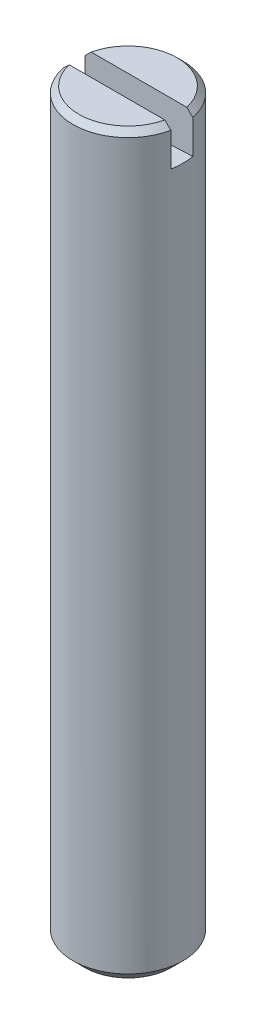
ISO-10303-21;
HEADER;
FILE_DESCRIPTION(('STEP AP214'),'2;1');
FILE_NAME('part.step','',(''),(''),'','','');
FILE_SCHEMA(('AUTOMOTIVE_DESIGN { 1 0 10303 214 1 1 1 1 }'));
ENDSEC;
DATA;
#1=APPLICATION_CONTEXT('core data for automotive mechanical design processes');
#2=APPLICATION_PROTOCOL_DEFINITION('international standard','automotive_design',2000,#1);
#3=PRODUCT_CONTEXT('',#1,'mechanical');
#4=PRODUCT('Part','Part','',(#3));
#5=PRODUCT_RELATED_PRODUCT_CATEGORY('part','',(#4));
#6=PRODUCT_DEFINITION_FORMATION('','',#4);
#7=PRODUCT_DEFINITION_CONTEXT('part definition',#1,'design');
#8=PRODUCT_DEFINITION('design','',#6,#7);
#9=PRODUCT_DEFINITION_SHAPE('','',#8);
#10=(LENGTH_UNIT() NAMED_UNIT(*) SI_UNIT(.MILLI.,.METRE.));
#11=(NAMED_UNIT(*) PLANE_ANGLE_UNIT() SI_UNIT($,.RADIAN.));
#12=(NAMED_UNIT(*) SI_UNIT($,.STERADIAN.) SOLID_ANGLE_UNIT());
#13=UNCERTAINTY_MEASURE_WITH_UNIT(LENGTH_MEASURE(1.E-05),#10,'distance_accuracy_value','');
#14=(GEOMETRIC_REPRESENTATION_CONTEXT(3) GLOBAL_UNCERTAINTY_ASSIGNED_CONTEXT((#13)) GLOBAL_UNIT_ASSIGNED_CONTEXT((#10,
#11,#12)) REPRESENTATION_CONTEXT('',''));
#15=CARTESIAN_POINT('',(0.,0.,0.));
#16=DIRECTION('',(0.,0.,1.));
#17=DIRECTION('',(1.,0.,0.));
#18=AXIS2_PLACEMENT_3D('',#15,#16,#17);
#19=CARTESIAN_POINT('',(0.,22.,0.));
#20=DIRECTION('',(0.,-1.,0.));
#21=DIRECTION('',(0.,0.,-1.));
#22=AXIS2_PLACEMENT_3D('',#19,#20,#21);
#23=PLANE('',#22);
#24=CARTESIAN_POINT('',(0.,21.9999999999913,0.));
#25=DIRECTION('',(0.,-1.,0.));
#26=DIRECTION('',(0.,0.,-1.));
#27=AXIS2_PLACEMENT_3D('',#24,#25,#26);
#28=CIRCLE('',#27,1.78549999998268);
#29=CARTESIAN_POINT('',(-1.74011788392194,21.9999999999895,-0.4));
#30=VERTEX_POINT('',#29);
#31=CARTESIAN_POINT('',(1.74011788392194,21.9999999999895,-0.4));
#32=VERTEX_POINT('',#31);
#33=EDGE_CURVE('E88',#30,#32,#28,.T.);
#34=ORIENTED_EDGE('',*,*,#33,.F.);
#35=DIRECTION('',(1.,0.,0.));
#36=VECTOR('',#35,1.);
#37=CARTESIAN_POINT('',(0.,22.,-0.4));
#38=LINE('',#37,#36);
#39=EDGE_CURVE('E20',#32,#30,#38,.F.);
#40=ORIENTED_EDGE('',*,*,#39,.F.);
#41=EDGE_LOOP('',(#34,#40));
#42=FACE_BOUND('',#41,.T.);
#43=ADVANCED_FACE('F15',(#42),#23,.F.);
#44=CARTESIAN_POINT('',(0.,22.,0.));
#45=DIRECTION('',(0.,-1.,0.));
#46=DIRECTION('',(0.,0.,-1.));
#47=AXIS2_PLACEMENT_3D('',#44,#45,#46);
#48=PLANE('',#47);
#49=DIRECTION('',(1.,0.,0.));
#50=VECTOR('',#49,1.);
#51=CARTESIAN_POINT('',(0.,22.,0.4));
#52=LINE('',#51,#50);
#53=CARTESIAN_POINT('',(-1.74011788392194,21.9999999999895,0.4));
#54=VERTEX_POINT('',#53);
#55=CARTESIAN_POINT('',(1.74011788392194,21.9999999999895,0.4));
#56=VERTEX_POINT('',#55);
#57=EDGE_CURVE('E82',#54,#56,#52,.T.);
#58=ORIENTED_EDGE('',*,*,#57,.F.);
#59=CARTESIAN_POINT('',(0.,21.9999999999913,0.));
#60=DIRECTION('',(0.,-1.,0.));
#61=DIRECTION('',(0.,0.,-1.));
#62=AXIS2_PLACEMENT_3D('',#59,#60,#61);
#63=CIRCLE('',#62,1.78549999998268);
#64=EDGE_CURVE('E75',#56,#54,#63,.T.);
#65=ORIENTED_EDGE('',*,*,#64,.F.);
#66=EDGE_LOOP('',(#58,#65));
#67=FACE_BOUND('',#66,.T.);
#68=ADVANCED_FACE('F87',(#67),#48,.F.);
#69=CARTESIAN_POINT('',(0.,21.7854999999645,0.));
#70=DIRECTION('',(0.,-1.,0.));
#71=DIRECTION('',(0.,0.,-1.));
#72=AXIS2_PLACEMENT_3D('',#69,#70,#71);
#73=CONICAL_SURFACE('',#72,2.00000000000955,0.785398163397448);
#74=CARTESIAN_POINT('',(-1.74011788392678,21.9999999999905,-0.400000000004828));
#75=CARTESIAN_POINT('',(-1.77674437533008,21.9642986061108,-0.400000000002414));
#76=CARTESIAN_POINT('',(-1.81334711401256,21.9285729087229,-0.400000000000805));
#77=CARTESIAN_POINT('',(-1.88650508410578,21.8570729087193,-0.399999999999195));
#78=CARTESIAN_POINT('',(-1.9230603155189,21.8212986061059,-0.399999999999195));
#79=CARTESIAN_POINT('',(-1.95959179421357,21.7854999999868,-0.4));
#80=B_SPLINE_CURVE_WITH_KNOTS('',3,(#74,#75,#76,#77,#78,#79),.UNSPECIFIED.,.F.,.F.,(4,2,4),(0.,
0.153443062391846,0.306886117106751),.UNSPECIFIED.);
#81=CARTESIAN_POINT('',(-1.95959179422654,21.785499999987,-0.4));
#82=VERTEX_POINT('',#81);
#83=EDGE_CURVE('E86',#30,#82,#80,.T.);
#84=ORIENTED_EDGE('',*,*,#83,.F.);
#85=ORIENTED_EDGE('',*,*,#33,.T.);
#86=CARTESIAN_POINT('',(1.95959179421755,21.7854999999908,-0.40000000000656));
#87=CARTESIAN_POINT('',(1.92306031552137,21.8212986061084,-0.40000000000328));
#88=CARTESIAN_POINT('',(1.88650508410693,21.8570729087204,-0.400000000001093));
#89=CARTESIAN_POINT('',(1.81334711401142,21.9285729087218,-0.399999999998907));
#90=CARTESIAN_POINT('',(1.77674437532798,21.9642986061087,-0.399999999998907));
#91=CARTESIAN_POINT('',(1.7401178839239,21.9999999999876,-0.4));
#92=B_SPLINE_CURVE_WITH_KNOTS('',3,(#86,#87,#88,#89,#90,#91),.UNSPECIFIED.,.F.,.F.,(4,2,4),(0.,
0.153443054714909,0.306886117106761),.UNSPECIFIED.);
#93=CARTESIAN_POINT('',(1.95959179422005,21.7854999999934,-0.4));
#94=VERTEX_POINT('',#93);
#95=EDGE_CURVE('E113',#94,#32,#92,.T.);
#96=ORIENTED_EDGE('',*,*,#95,.F.);
#97=CARTESIAN_POINT('',(0.,21.7855,0.));
#98=DIRECTION('',(0.,-1.,0.));
#99=DIRECTION('',(0.,0.,-1.));
#100=AXIS2_PLACEMENT_3D('',#97,#98,#99);
#101=CIRCLE('',#100,2.);
#102=EDGE_CURVE('E102',#82,#94,#101,.T.);
#103=ORIENTED_EDGE('',*,*,#102,.F.);
#104=EDGE_LOOP('',(#84,#85,#96,#103));
#105=FACE_BOUND('',#104,.T.);
#106=ADVANCED_FACE('F129',(#105),#73,.T.);
#107=CARTESIAN_POINT('',(0.,52.,-0.4));
#108=DIRECTION('',(0.,0.,1.));
#109=DIRECTION('',(1.,0.,0.));
#110=AXIS2_PLACEMENT_3D('',#107,#108,#109);
#111=PLANE('',#110);
#112=ORIENTED_EDGE('',*,*,#39,.T.);
#113=ORIENTED_EDGE('',*,*,#83,.T.);
#114=DIRECTION('',(0.,1.,0.));
#115=VECTOR('',#114,1.);
#116=CARTESIAN_POINT('',(-1.95959179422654,52.,-0.4));
#117=LINE('',#116,#115);
#118=CARTESIAN_POINT('',(-1.95959179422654,20.5610114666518,-0.4));
#119=VERTEX_POINT('',#118);
#120=EDGE_CURVE('E59',#82,#119,#117,.F.);
#121=ORIENTED_EDGE('',*,*,#120,.T.);
#122=CARTESIAN_POINT('',(0.,52.,-0.4));
#123=DIRECTION('',(0.,0.,-1.));
#124=DIRECTION('',(-1.,0.,0.));
#125=AXIS2_PLACEMENT_3D('',#122,#123,#124);
#126=CIRCLE('',#125,31.5);
#127=CARTESIAN_POINT('',(1.95959179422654,20.5610114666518,-0.4));
#128=VERTEX_POINT('',#127);
#129=EDGE_CURVE('E110',#119,#128,#126,.F.);
#130=ORIENTED_EDGE('',*,*,#129,.T.);
#131=DIRECTION('',(0.,1.,0.));
#132=VECTOR('',#131,1.);
#133=CARTESIAN_POINT('',(1.95959179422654,52.,-0.4));
#134=LINE('',#133,#132);
#135=EDGE_CURVE('E111',#128,#94,#134,.T.);
#136=ORIENTED_EDGE('',*,*,#135,.T.);
#137=ORIENTED_EDGE('',*,*,#95,.T.);
#138=EDGE_LOOP('',(#112,#113,#121,#130,#136,#137));
#139=FACE_BOUND('',#138,.T.);
#140=ADVANCED_FACE('F125',(#139),#111,.T.);
#141=CARTESIAN_POINT('',(0.,21.7854999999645,0.));
#142=DIRECTION('',(0.,-1.,0.));
#143=DIRECTION('',(0.,0.,-1.));
#144=AXIS2_PLACEMENT_3D('',#141,#142,#143);
#145=CONICAL_SURFACE('',#144,2.00000000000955,0.785398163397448);
#146=ORIENTED_EDGE('',*,*,#64,.T.);
#147=CARTESIAN_POINT('',(-1.74011788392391,21.9999999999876,0.4));
#148=CARTESIAN_POINT('',(-1.77674437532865,21.9642986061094,0.4));
#149=CARTESIAN_POINT('',(-1.81334711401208,21.9285729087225,0.4));
#150=CARTESIAN_POINT('',(-1.88650508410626,21.8570729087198,0.4));
#151=CARTESIAN_POINT('',(-1.92306031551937,21.8212986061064,0.4));
#152=CARTESIAN_POINT('',(-1.95959179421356,21.7854999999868,0.4));
#153=B_SPLINE_CURVE_WITH_KNOTS('',3,(#147,#148,#149,#150,#151,#152),.UNSPECIFIED.,.F.,.F.,(4,2,
4),(0.,0.153443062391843,0.306886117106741),.UNSPECIFIED.);
#154=CARTESIAN_POINT('',(-1.95959179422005,21.7854999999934,0.4));
#155=VERTEX_POINT('',#154);
#156=EDGE_CURVE('E35',#54,#155,#153,.T.);
#157=ORIENTED_EDGE('',*,*,#156,.T.);
#158=CARTESIAN_POINT('',(0.,21.7855,0.));
#159=DIRECTION('',(0.,-1.,0.));
#160=DIRECTION('',(0.,0.,-1.));
#161=AXIS2_PLACEMENT_3D('',#158,#159,#160);
#162=CIRCLE('',#161,2.);
#163=CARTESIAN_POINT('',(1.95959179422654,21.785499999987,0.4));
#164=VERTEX_POINT('',#163);
#165=EDGE_CURVE('E76',#164,#155,#162,.T.);
#166=ORIENTED_EDGE('',*,*,#165,.F.);
#167=CARTESIAN_POINT('',(1.95959179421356,21.7854999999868,0.4));
#168=CARTESIAN_POINT('',(1.92306031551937,21.8212986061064,0.4));
#169=CARTESIAN_POINT('',(1.88650508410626,21.8570729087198,0.4));
#170=CARTESIAN_POINT('',(1.81334711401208,21.9285729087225,0.4));
#171=CARTESIAN_POINT('',(1.77674437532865,21.9642986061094,0.4));
#172=CARTESIAN_POINT('',(1.74011788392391,21.9999999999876,0.4));
#173=B_SPLINE_CURVE_WITH_KNOTS('',3,(#167,#168,#169,#170,#171,#172),.UNSPECIFIED.,.F.,.F.,(4,2,
4),(0.,0.153443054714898,0.306886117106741),.UNSPECIFIED.);
#174=EDGE_CURVE('E71',#164,#56,#173,.T.);
#175=ORIENTED_EDGE('',*,*,#174,.T.);
#176=EDGE_LOOP('',(#146,#157,#166,#175));
#177=FACE_BOUND('',#176,.T.);
#178=ADVANCED_FACE('F73',(#177),#145,.T.);
#179=CARTESIAN_POINT('',(0.,52.,0.4));
#180=DIRECTION('',(0.,0.,1.));
#181=DIRECTION('',(1.,0.,0.));
#182=AXIS2_PLACEMENT_3D('',#179,#180,#181);
#183=PLANE('',#182);
#184=ORIENTED_EDGE('',*,*,#57,.T.);
#185=ORIENTED_EDGE('',*,*,#174,.F.);
#186=DIRECTION('',(0.,1.,0.));
#187=VECTOR('',#186,1.);
#188=CARTESIAN_POINT('',(1.95959179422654,52.,0.4));
#189=LINE('',#188,#187);
#190=CARTESIAN_POINT('',(1.95959179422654,20.5610114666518,0.4));
#191=VERTEX_POINT('',#190);
#192=EDGE_CURVE('E79',#191,#164,#189,.T.);
#193=ORIENTED_EDGE('',*,*,#192,.F.);
#194=CARTESIAN_POINT('',(0.,52.,0.4));
#195=DIRECTION('',(0.,0.,-1.));
#196=DIRECTION('',(-1.,0.,0.));
#197=AXIS2_PLACEMENT_3D('',#194,#195,#196);
#198=CIRCLE('',#197,31.5);
#199=CARTESIAN_POINT('',(-1.95959179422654,20.5610114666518,0.4));
#200=VERTEX_POINT('',#199);
#201=EDGE_CURVE('E107',#200,#191,#198,.F.);
#202=ORIENTED_EDGE('',*,*,#201,.F.);
#203=DIRECTION('',(0.,1.,0.));
#204=VECTOR('',#203,1.);
#205=CARTESIAN_POINT('',(-1.95959179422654,52.,0.4));
#206=LINE('',#205,#204);
#207=EDGE_CURVE('E105',#155,#200,#206,.F.);
#208=ORIENTED_EDGE('',*,*,#207,.F.);
#209=ORIENTED_EDGE('',*,*,#156,.F.);
#210=EDGE_LOOP('',(#184,#185,#193,#202,#208,#209));
#211=FACE_BOUND('',#210,.T.);
#212=ADVANCED_FACE('F83',(#211),#183,.F.);
#213=CARTESIAN_POINT('',(0.,52.,0.4));
#214=DIRECTION('',(0.,0.,-1.));
#215=DIRECTION('',(-1.,0.,0.));
#216=AXIS2_PLACEMENT_3D('',#213,#214,#215);
#217=CYLINDRICAL_SURFACE('',#216,31.5);
#218=CARTESIAN_POINT('',(1.95959179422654,20.5610114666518,-0.4));
#219=CARTESIAN_POINT('',(1.97091486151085,20.5617184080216,-0.344561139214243));
#220=CARTESIAN_POINT('',(1.97987306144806,20.562281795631,-0.288637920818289));
#221=CARTESIAN_POINT('',(1.99302430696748,20.5631121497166,-0.1762131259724));
#222=CARTESIAN_POINT('',(1.99721579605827,20.5633790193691,-0.119711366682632));
#223=CARTESIAN_POINT('',(2.0007609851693,20.5636046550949,-0.00749894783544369));
#224=CARTESIAN_POINT('',(2.00019410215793,20.5635684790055,0.0482092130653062));
#225=CARTESIAN_POINT('',(1.99441663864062,20.5632012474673,0.15936012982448));
#226=CARTESIAN_POINT('',(1.98920814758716,20.5628703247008,0.21480299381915));
#227=CARTESIAN_POINT('',(1.97576492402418,20.562023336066,0.313516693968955));
#228=CARTESIAN_POINT('',(1.96839158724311,20.561560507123,0.356906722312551));
#229=CARTESIAN_POINT('',(1.95959179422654,20.5610114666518,0.4));
#230=B_SPLINE_CURVE_WITH_KNOTS('',3,(#218,#219,#220,#221,#222,#223,#224,#225,#226,#227,#228,
#229),.UNSPECIFIED.,.F.,.F.,(4,2,2,2,2,4),(0.,0.169712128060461,0.33947965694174,
0.506419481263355,0.673284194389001,0.805229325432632),.UNSPECIFIED.);
#231=EDGE_CURVE('E26',#128,#191,#230,.T.);
#232=ORIENTED_EDGE('',*,*,#231,.F.);
#233=ORIENTED_EDGE('',*,*,#129,.F.);
#234=CARTESIAN_POINT('',(-1.95959179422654,20.5610114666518,0.4));
#235=CARTESIAN_POINT('',(-1.97091486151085,20.5617184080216,0.344561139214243));
#236=CARTESIAN_POINT('',(-1.97987306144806,20.562281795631,0.28863792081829));
#237=CARTESIAN_POINT('',(-1.99302430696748,20.5631121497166,0.176213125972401));
#238=CARTESIAN_POINT('',(-1.99721579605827,20.5633790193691,0.119711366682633));
#239=CARTESIAN_POINT('',(-2.0007609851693,20.5636046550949,0.00749894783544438));
#240=CARTESIAN_POINT('',(-2.00019410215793,20.5635684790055,-0.0482092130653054));
#241=CARTESIAN_POINT('',(-1.99441663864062,20.5632012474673,-0.159360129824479));
#242=CARTESIAN_POINT('',(-1.98920814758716,20.5628703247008,-0.214802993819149));
#243=CARTESIAN_POINT('',(-1.97576492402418,20.562023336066,-0.313516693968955));
#244=CARTESIAN_POINT('',(-1.96839158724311,20.561560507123,-0.356906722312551));
#245=CARTESIAN_POINT('',(-1.95959179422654,20.5610114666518,-0.4));
#246=B_SPLINE_CURVE_WITH_KNOTS('',3,(#234,#235,#236,#237,#238,#239,#240,#241,#242,#243,#244,
#245),.UNSPECIFIED.,.F.,.F.,(4,2,2,2,2,4),(0.,0.169712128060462,0.33947965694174,
0.506419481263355,0.673284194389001,0.805229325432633),.UNSPECIFIED.);
#247=EDGE_CURVE('E10',#200,#119,#246,.T.);
#248=ORIENTED_EDGE('',*,*,#247,.F.);
#249=ORIENTED_EDGE('',*,*,#201,.T.);
#250=EDGE_LOOP('',(#232,#233,#248,#249));
#251=FACE_BOUND('',#250,.T.);
#252=ADVANCED_FACE('F152',(#251),#217,.F.);
#253=CARTESIAN_POINT('',(0.,15.,0.));
#254=DIRECTION('',(0.,-1.,0.));
#255=DIRECTION('',(0.,0.,-1.));
#256=AXIS2_PLACEMENT_3D('',#253,#254,#255);
#257=CYLINDRICAL_SURFACE('',#256,2.);
#258=ORIENTED_EDGE('',*,*,#231,.T.);
#259=ORIENTED_EDGE('',*,*,#192,.T.);
#260=ORIENTED_EDGE('',*,*,#165,.T.);
#261=ORIENTED_EDGE('',*,*,#207,.T.);
#262=ORIENTED_EDGE('',*,*,#247,.T.);
#263=ORIENTED_EDGE('',*,*,#120,.F.);
#264=ORIENTED_EDGE('',*,*,#102,.T.);
#265=ORIENTED_EDGE('',*,*,#135,.F.);
#266=EDGE_LOOP('',(#258,#259,#260,#261,#262,#263,#264,#265));
#267=FACE_BOUND('',#266,.T.);
#268=CARTESIAN_POINT('',(0.,-4.5705,0.));
#269=DIRECTION('',(0.,-1.,0.));
#270=DIRECTION('',(0.,0.,-1.));
#271=AXIS2_PLACEMENT_3D('',#268,#269,#270);
#272=CIRCLE('',#271,2.);
#273=CARTESIAN_POINT('',(0.,-4.5705,-2.));
#274=VERTEX_POINT('',#273);
#275=EDGE_CURVE('E104',#274,#274,#272,.T.);
#276=ORIENTED_EDGE('',*,*,#275,.F.);
#277=EDGE_LOOP('',(#276));
#278=FACE_BOUND('',#277,.T.);
#279=ADVANCED_FACE('F17',(#267,#278),#257,.T.);
#280=CARTESIAN_POINT('',(1.5705,-5.,0.));
#281=DIRECTION('',(0.,1.,0.));
#282=DIRECTION('',(0.,0.,1.));
#283=AXIS2_PLACEMENT_3D('',#280,#281,#282);
#284=PLANE('',#283);
#285=CARTESIAN_POINT('',(0.,-5.00000000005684,0.));
#286=DIRECTION('',(0.,1.,0.));
#287=DIRECTION('',(-1.,0.,0.));
#288=AXIS2_PLACEMENT_3D('',#285,#286,#287);
#289=CIRCLE('',#288,1.57050000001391);
#290=CARTESIAN_POINT('',(-1.57050000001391,-5.00000000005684,0.));
#291=VERTEX_POINT('',#290);
#292=EDGE_CURVE('E172',#291,#291,#289,.T.);
#293=ORIENTED_EDGE('',*,*,#292,.F.);
#294=EDGE_LOOP('',(#293));
#295=FACE_BOUND('',#294,.T.);
#296=ADVANCED_FACE('F158',(#295),#284,.F.);
#297=CARTESIAN_POINT('',(0.,-4.57050000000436,0.));
#298=DIRECTION('',(0.,1.,0.));
#299=DIRECTION('',(-1.,0.,0.));
#300=AXIS2_PLACEMENT_3D('',#297,#298,#299);
#301=CONICAL_SURFACE('',#300,2.00000000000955,0.785398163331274);
#302=ORIENTED_EDGE('',*,*,#275,.T.);
#303=EDGE_LOOP('',(#302));
#304=FACE_BOUND('',#303,.T.);
#305=ORIENTED_EDGE('',*,*,#292,.T.);
#306=EDGE_LOOP('',(#305));
#307=FACE_BOUND('',#306,.T.);
#308=ADVANCED_FACE('F178',(#304,#307),#301,.T.);
#309=CLOSED_SHELL('',(#43,#68,#106,#140,#178,#212,#252,#279,#296,#308));
#310=MANIFOLD_SOLID_BREP('B1',#309);
#311=ADVANCED_BREP_SHAPE_REPRESENTATION('',(#18,#310),#14);
#312=SHAPE_DEFINITION_REPRESENTATION(#9,#311);
ENDSEC;
END-ISO-10303-21;
